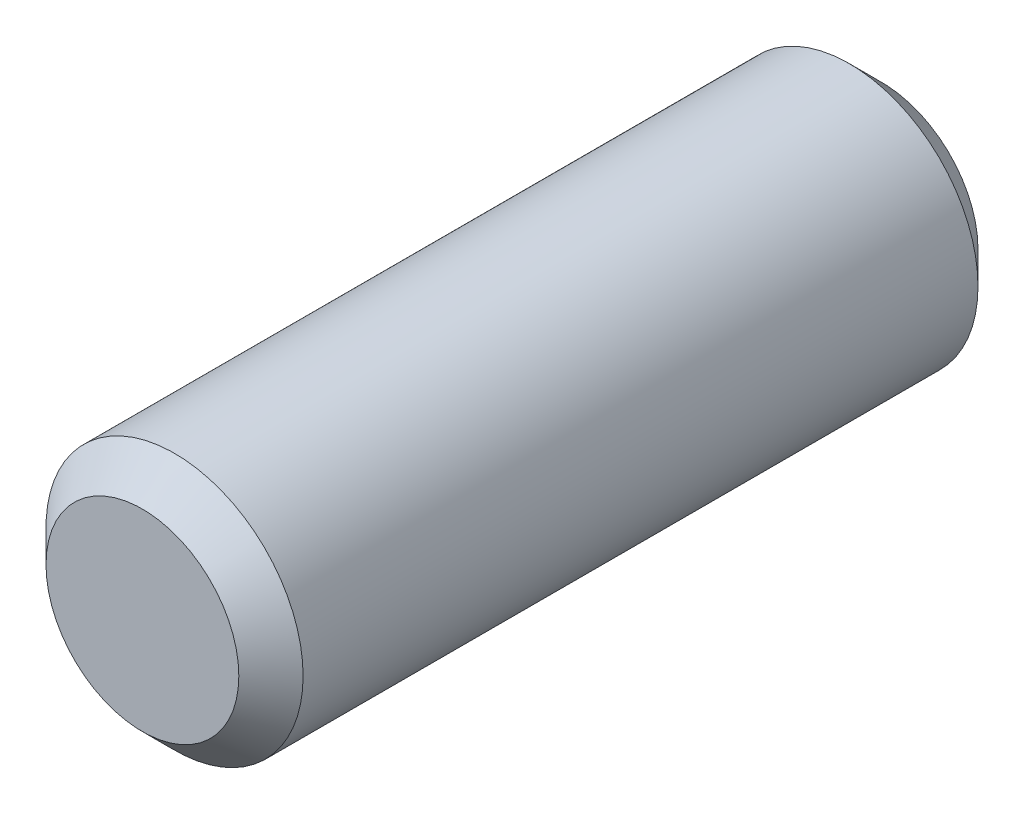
ISO-10303-21;
HEADER;
FILE_DESCRIPTION(('STEP AP214'),'2;1');
FILE_NAME('part.step','',(''),(''),'','','');
FILE_SCHEMA(('AUTOMOTIVE_DESIGN { 1 0 10303 214 1 1 1 1 }'));
ENDSEC;
DATA;
#1=APPLICATION_CONTEXT('core data for automotive mechanical design processes');
#2=APPLICATION_PROTOCOL_DEFINITION('international standard','automotive_design',2000,#1);
#3=PRODUCT_CONTEXT('',#1,'mechanical');
#4=PRODUCT('Part','Part','',(#3));
#5=PRODUCT_RELATED_PRODUCT_CATEGORY('part','',(#4));
#6=PRODUCT_DEFINITION_FORMATION('','',#4);
#7=PRODUCT_DEFINITION_CONTEXT('part definition',#1,'design');
#8=PRODUCT_DEFINITION('design','',#6,#7);
#9=PRODUCT_DEFINITION_SHAPE('','',#8);
#10=(LENGTH_UNIT() NAMED_UNIT(*) SI_UNIT(.MILLI.,.METRE.));
#11=(NAMED_UNIT(*) PLANE_ANGLE_UNIT() SI_UNIT($,.RADIAN.));
#12=(NAMED_UNIT(*) SI_UNIT($,.STERADIAN.) SOLID_ANGLE_UNIT());
#13=UNCERTAINTY_MEASURE_WITH_UNIT(LENGTH_MEASURE(1.E-05),#10,'distance_accuracy_value','');
#14=(GEOMETRIC_REPRESENTATION_CONTEXT(3) GLOBAL_UNCERTAINTY_ASSIGNED_CONTEXT((#13)) GLOBAL_UNIT_ASSIGNED_CONTEXT((#10,
#11,#12)) REPRESENTATION_CONTEXT('',''));
#15=CARTESIAN_POINT('',(0.,0.,0.));
#16=DIRECTION('',(0.,0.,1.));
#17=DIRECTION('',(1.,0.,0.));
#18=AXIS2_PLACEMENT_3D('',#15,#16,#17);
#19=CARTESIAN_POINT('',(0.,0.,-12.));
#20=DIRECTION('',(0.,0.,1.));
#21=DIRECTION('',(1.,0.,0.));
#22=AXIS2_PLACEMENT_3D('',#19,#20,#21);
#23=CYLINDRICAL_SURFACE('',#22,4.);
#24=CARTESIAN_POINT('',(0.,0.,9.99999999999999));
#25=DIRECTION('',(0.,0.,1.));
#26=DIRECTION('',(1.,0.,0.));
#27=AXIS2_PLACEMENT_3D('',#24,#25,#26);
#28=CIRCLE('',#27,4.);
#29=CARTESIAN_POINT('',(4.,0.,9.99999999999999));
#30=VERTEX_POINT('',#29);
#31=EDGE_CURVE('E38',#30,#30,#28,.F.);
#32=ORIENTED_EDGE('',*,*,#31,.T.);
#33=EDGE_LOOP('',(#32));
#34=FACE_BOUND('',#33,.T.);
#35=CARTESIAN_POINT('',(0.,0.,-11.));
#36=DIRECTION('',(0.,0.,1.));
#37=DIRECTION('',(1.,0.,0.));
#38=AXIS2_PLACEMENT_3D('',#35,#36,#37);
#39=CIRCLE('',#38,4.);
#40=CARTESIAN_POINT('',(4.,0.,-11.));
#41=VERTEX_POINT('',#40);
#42=EDGE_CURVE('E42',#41,#41,#39,.T.);
#43=ORIENTED_EDGE('',*,*,#42,.T.);
#44=EDGE_LOOP('',(#43));
#45=FACE_BOUND('',#44,.T.);
#46=ADVANCED_FACE('F31',(#34,#45),#23,.T.);
#47=CARTESIAN_POINT('',(0.,0.,-12.));
#48=DIRECTION('',(0.,0.,1.));
#49=DIRECTION('',(1.,0.,0.));
#50=AXIS2_PLACEMENT_3D('',#47,#48,#49);
#51=PLANE('',#50);
#52=CARTESIAN_POINT('',(0.,0.,-12.));
#53=DIRECTION('',(0.,0.,1.));
#54=DIRECTION('',(1.,0.,0.));
#55=AXIS2_PLACEMENT_3D('',#52,#53,#54);
#56=CIRCLE('',#55,3.);
#57=CARTESIAN_POINT('',(3.,0.,-12.));
#58=VERTEX_POINT('',#57);
#59=EDGE_CURVE('E10',#58,#58,#56,.F.);
#60=ORIENTED_EDGE('',*,*,#59,.T.);
#61=EDGE_LOOP('',(#60));
#62=FACE_BOUND('',#61,.T.);
#63=ADVANCED_FACE('F62',(#62),#51,.F.);
#64=CARTESIAN_POINT('',(0.,0.,11.));
#65=DIRECTION('',(0.,0.,1.));
#66=DIRECTION('',(1.,0.,0.));
#67=AXIS2_PLACEMENT_3D('',#64,#65,#66);
#68=PLANE('',#67);
#69=CARTESIAN_POINT('',(0.,0.,11.));
#70=DIRECTION('',(0.,0.,1.));
#71=DIRECTION('',(1.,0.,0.));
#72=AXIS2_PLACEMENT_3D('',#69,#70,#71);
#73=CIRCLE('',#72,3.);
#74=CARTESIAN_POINT('',(3.,0.,11.));
#75=VERTEX_POINT('',#74);
#76=EDGE_CURVE('E46',#75,#75,#73,.T.);
#77=ORIENTED_EDGE('',*,*,#76,.T.);
#78=EDGE_LOOP('',(#77));
#79=FACE_BOUND('',#78,.T.);
#80=ADVANCED_FACE('F52',(#79),#68,.T.);
#81=CARTESIAN_POINT('',(0.,0.,11.));
#82=DIRECTION('',(0.,0.,-1.));
#83=DIRECTION('',(-1.,0.,0.));
#84=AXIS2_PLACEMENT_3D('',#81,#82,#83);
#85=CONICAL_SURFACE('',#84,3.,0.785398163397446);
#86=ORIENTED_EDGE('',*,*,#31,.F.);
#87=EDGE_LOOP('',(#86));
#88=FACE_BOUND('',#87,.T.);
#89=ORIENTED_EDGE('',*,*,#76,.F.);
#90=EDGE_LOOP('',(#89));
#91=FACE_BOUND('',#90,.T.);
#92=ADVANCED_FACE('F54',(#88,#91),#85,.T.);
#93=CARTESIAN_POINT('',(0.,0.,-11.));
#94=DIRECTION('',(0.,0.,1.));
#95=DIRECTION('',(1.,0.,0.));
#96=AXIS2_PLACEMENT_3D('',#93,#94,#95);
#97=CONICAL_SURFACE('',#96,4.,0.78539816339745);
#98=ORIENTED_EDGE('',*,*,#59,.F.);
#99=EDGE_LOOP('',(#98));
#100=FACE_BOUND('',#99,.T.);
#101=ORIENTED_EDGE('',*,*,#42,.F.);
#102=EDGE_LOOP('',(#101));
#103=FACE_BOUND('',#102,.T.);
#104=ADVANCED_FACE('F33',(#100,#103),#97,.T.);
#105=CLOSED_SHELL('',(#46,#63,#80,#92,#104));
#106=MANIFOLD_SOLID_BREP('B2',#105);
#107=ADVANCED_BREP_SHAPE_REPRESENTATION('',(#18,#106),#14);
#108=SHAPE_DEFINITION_REPRESENTATION(#9,#107);
ENDSEC;
END-ISO-10303-21;
